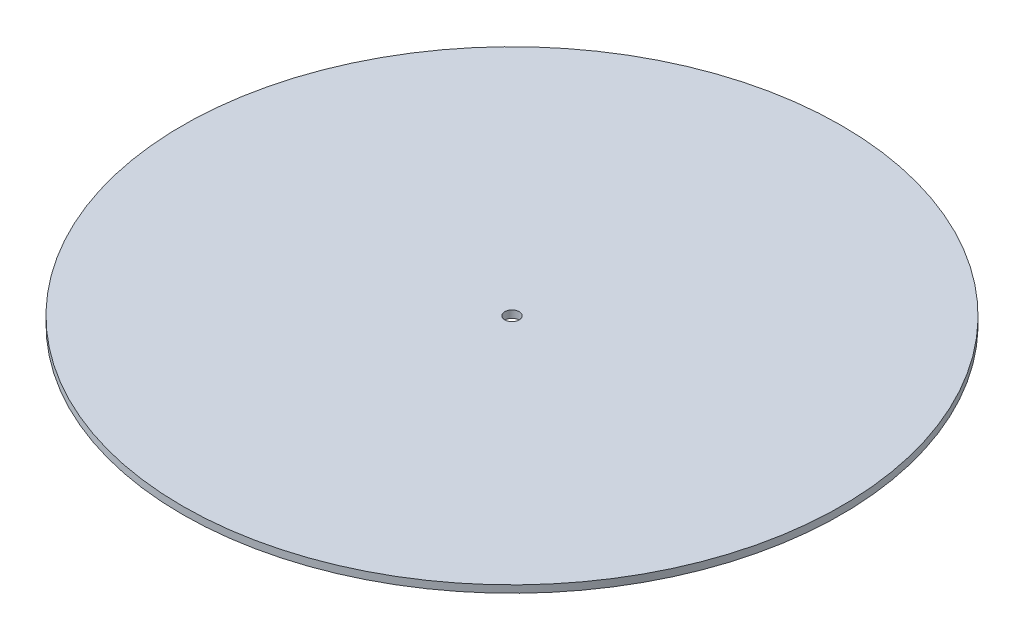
ISO-10303-21;
HEADER;
FILE_DESCRIPTION(('STEP AP214'),'2;1');
FILE_NAME('part.step','',(''),(''),'','','');
FILE_SCHEMA(('AUTOMOTIVE_DESIGN { 1 0 10303 214 1 1 1 1 }'));
ENDSEC;
DATA;
#1=APPLICATION_CONTEXT('core data for automotive mechanical design processes');
#2=APPLICATION_PROTOCOL_DEFINITION('international standard','automotive_design',2000,#1);
#3=PRODUCT_CONTEXT('',#1,'mechanical');
#4=PRODUCT('Part','Part','',(#3));
#5=PRODUCT_RELATED_PRODUCT_CATEGORY('part','',(#4));
#6=PRODUCT_DEFINITION_FORMATION('','',#4);
#7=PRODUCT_DEFINITION_CONTEXT('part definition',#1,'design');
#8=PRODUCT_DEFINITION('design','',#6,#7);
#9=PRODUCT_DEFINITION_SHAPE('','',#8);
#10=(LENGTH_UNIT() NAMED_UNIT(*) SI_UNIT(.MILLI.,.METRE.));
#11=(NAMED_UNIT(*) PLANE_ANGLE_UNIT() SI_UNIT($,.RADIAN.));
#12=(NAMED_UNIT(*) SI_UNIT($,.STERADIAN.) SOLID_ANGLE_UNIT());
#13=UNCERTAINTY_MEASURE_WITH_UNIT(LENGTH_MEASURE(1.E-05),#10,'distance_accuracy_value','');
#14=(GEOMETRIC_REPRESENTATION_CONTEXT(3) GLOBAL_UNCERTAINTY_ASSIGNED_CONTEXT((#13)) GLOBAL_UNIT_ASSIGNED_CONTEXT((#10,
#11,#12)) REPRESENTATION_CONTEXT('',''));
#15=CARTESIAN_POINT('',(0.,0.,0.));
#16=DIRECTION('',(0.,0.,1.));
#17=DIRECTION('',(1.,0.,0.));
#18=AXIS2_PLACEMENT_3D('',#15,#16,#17);
#19=CARTESIAN_POINT('',(0.,2.54,0.));
#20=DIRECTION('',(0.,1.,0.));
#21=DIRECTION('',(0.,0.,1.));
#22=AXIS2_PLACEMENT_3D('',#19,#20,#21);
#23=PLANE('',#22);
#24=CARTESIAN_POINT('',(0.,2.54,0.));
#25=DIRECTION('',(0.,1.,0.));
#26=DIRECTION('',(0.,0.,1.));
#27=AXIS2_PLACEMENT_3D('',#24,#25,#26);
#28=CIRCLE('',#27,114.7445);
#29=CARTESIAN_POINT('',(0.,2.54,114.7445));
#30=VERTEX_POINT('',#29);
#31=EDGE_CURVE('E10',#30,#30,#28,.T.);
#32=ORIENTED_EDGE('',*,*,#31,.T.);
#33=EDGE_LOOP('',(#32));
#34=FACE_BOUND('',#33,.T.);
#35=CARTESIAN_POINT('',(0.,2.54,0.));
#36=DIRECTION('',(0.,1.,0.));
#37=DIRECTION('',(0.,0.,1.));
#38=AXIS2_PLACEMENT_3D('',#35,#36,#37);
#39=CIRCLE('',#38,2.499995);
#40=CARTESIAN_POINT('',(0.,2.54,2.499995));
#41=VERTEX_POINT('',#40);
#42=EDGE_CURVE('E52',#41,#41,#39,.T.);
#43=ORIENTED_EDGE('',*,*,#42,.F.);
#44=EDGE_LOOP('',(#43));
#45=FACE_BOUND('',#44,.T.);
#46=ADVANCED_FACE('F41',(#34,#45),#23,.T.);
#47=CARTESIAN_POINT('',(0.,0.,0.));
#48=DIRECTION('',(0.,1.,0.));
#49=DIRECTION('',(0.,0.,1.));
#50=AXIS2_PLACEMENT_3D('',#47,#48,#49);
#51=PLANE('',#50);
#52=CARTESIAN_POINT('',(0.,0.,0.));
#53=DIRECTION('',(0.,1.,0.));
#54=DIRECTION('',(0.,0.,1.));
#55=AXIS2_PLACEMENT_3D('',#52,#53,#54);
#56=CIRCLE('',#55,114.7445);
#57=CARTESIAN_POINT('',(0.,0.,114.7445));
#58=VERTEX_POINT('',#57);
#59=EDGE_CURVE('E45',#58,#58,#56,.T.);
#60=ORIENTED_EDGE('',*,*,#59,.F.);
#61=EDGE_LOOP('',(#60));
#62=FACE_BOUND('',#61,.T.);
#63=CARTESIAN_POINT('',(0.,0.,0.));
#64=DIRECTION('',(0.,1.,0.));
#65=DIRECTION('',(0.,0.,1.));
#66=AXIS2_PLACEMENT_3D('',#63,#64,#65);
#67=CIRCLE('',#66,2.499995);
#68=CARTESIAN_POINT('',(0.,0.,2.499995));
#69=VERTEX_POINT('',#68);
#70=EDGE_CURVE('E54',#69,#69,#67,.T.);
#71=ORIENTED_EDGE('',*,*,#70,.T.);
#72=EDGE_LOOP('',(#71));
#73=FACE_BOUND('',#72,.T.);
#74=ADVANCED_FACE('F64',(#62,#73),#51,.F.);
#75=CARTESIAN_POINT('',(0.,2.54,0.));
#76=DIRECTION('',(0.,-1.,0.));
#77=DIRECTION('',(0.,0.,-1.));
#78=AXIS2_PLACEMENT_3D('',#75,#76,#77);
#79=CYLINDRICAL_SURFACE('',#78,114.7445);
#80=ORIENTED_EDGE('',*,*,#31,.F.);
#81=EDGE_LOOP('',(#80));
#82=FACE_BOUND('',#81,.T.);
#83=ORIENTED_EDGE('',*,*,#59,.T.);
#84=EDGE_LOOP('',(#83));
#85=FACE_BOUND('',#84,.T.);
#86=ADVANCED_FACE('F43',(#82,#85),#79,.T.);
#87=CARTESIAN_POINT('',(0.,2.54,0.));
#88=DIRECTION('',(0.,-1.,0.));
#89=DIRECTION('',(0.,0.,-1.));
#90=AXIS2_PLACEMENT_3D('',#87,#88,#89);
#91=CYLINDRICAL_SURFACE('',#90,2.499995);
#92=ORIENTED_EDGE('',*,*,#42,.T.);
#93=EDGE_LOOP('',(#92));
#94=FACE_BOUND('',#93,.T.);
#95=ORIENTED_EDGE('',*,*,#70,.F.);
#96=EDGE_LOOP('',(#95));
#97=FACE_BOUND('',#96,.T.);
#98=ADVANCED_FACE('F60',(#94,#97),#91,.F.);
#99=CLOSED_SHELL('',(#46,#74,#86,#98));
#100=MANIFOLD_SOLID_BREP('B2',#99);
#101=ADVANCED_BREP_SHAPE_REPRESENTATION('',(#18,#100),#14);
#102=SHAPE_DEFINITION_REPRESENTATION(#9,#101);
ENDSEC;
END-ISO-10303-21;
